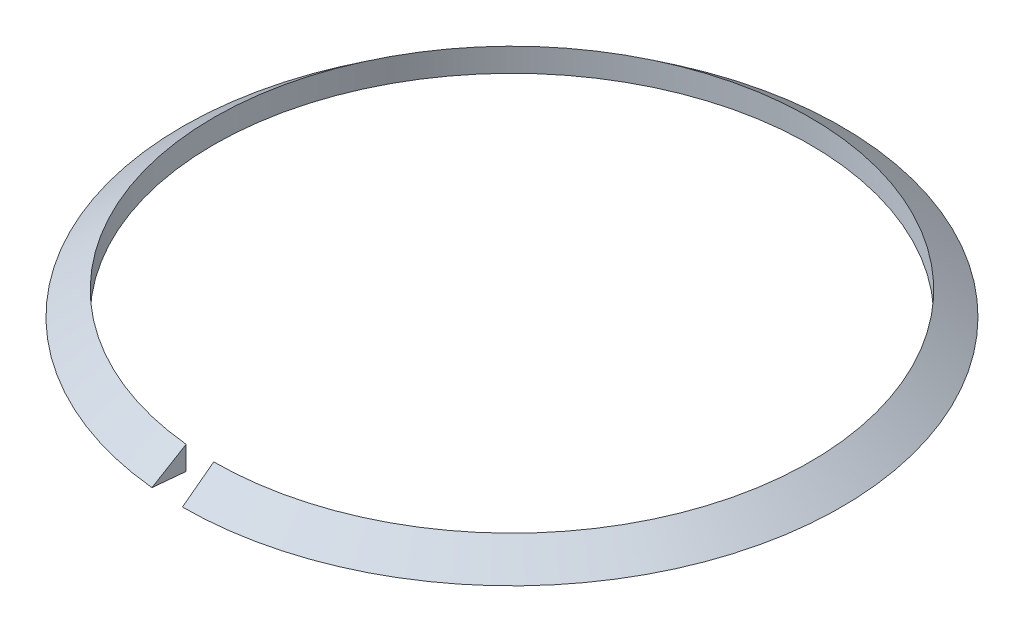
from build123d import *

# Parameters (mm, degrees)
REVOLVE1_ANGLE = 354.415


with BuildPart() as part:
    # Sketch1 → Revolve1 (revolve)
    with BuildSketch(Plane(origin=(0, 0, 0), x_dir=(0, 0, -1), z_dir=(1, 0, 0))):
        Polygon((-19.05, 0.75057), (-19.05, -0.75057), (-21.04898, -0.75057), align=None)
    revolve(axis=Axis((0, 0, 0), (0, 1, 0)), revolution_arc=REVOLVE1_ANGLE)


solid = part.part
